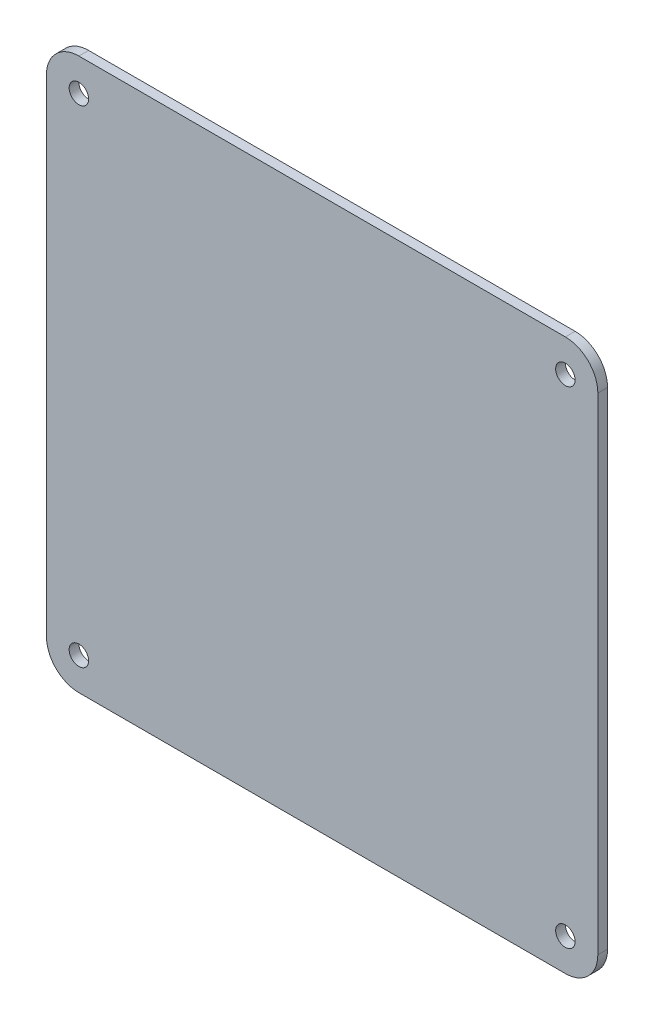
ISO-10303-21;
HEADER;
FILE_DESCRIPTION(('STEP AP214'),'2;1');
FILE_NAME('part.step','',(''),(''),'','','');
FILE_SCHEMA(('AUTOMOTIVE_DESIGN { 1 0 10303 214 1 1 1 1 }'));
ENDSEC;
DATA;
#1=APPLICATION_CONTEXT('core data for automotive mechanical design processes');
#2=APPLICATION_PROTOCOL_DEFINITION('international standard','automotive_design',2000,#1);
#3=PRODUCT_CONTEXT('',#1,'mechanical');
#4=PRODUCT('Part','Part','',(#3));
#5=PRODUCT_RELATED_PRODUCT_CATEGORY('part','',(#4));
#6=PRODUCT_DEFINITION_FORMATION('','',#4);
#7=PRODUCT_DEFINITION_CONTEXT('part definition',#1,'design');
#8=PRODUCT_DEFINITION('design','',#6,#7);
#9=PRODUCT_DEFINITION_SHAPE('','',#8);
#10=(LENGTH_UNIT() NAMED_UNIT(*) SI_UNIT(.MILLI.,.METRE.));
#11=(NAMED_UNIT(*) PLANE_ANGLE_UNIT() SI_UNIT($,.RADIAN.));
#12=(NAMED_UNIT(*) SI_UNIT($,.STERADIAN.) SOLID_ANGLE_UNIT());
#13=UNCERTAINTY_MEASURE_WITH_UNIT(LENGTH_MEASURE(1.E-05),#10,'distance_accuracy_value','');
#14=(GEOMETRIC_REPRESENTATION_CONTEXT(3) GLOBAL_UNCERTAINTY_ASSIGNED_CONTEXT((#13)) GLOBAL_UNIT_ASSIGNED_CONTEXT((#10,
#11,#12)) REPRESENTATION_CONTEXT('',''));
#15=CARTESIAN_POINT('',(0.,0.,0.));
#16=DIRECTION('',(0.,0.,1.));
#17=DIRECTION('',(1.,0.,0.));
#18=AXIS2_PLACEMENT_3D('',#15,#16,#17);
#19=CARTESIAN_POINT('',(75.,-75.,3.));
#20=DIRECTION('',(0.,0.,1.));
#21=DIRECTION('',(1.,0.,0.));
#22=AXIS2_PLACEMENT_3D('',#19,#20,#21);
#23=PLANE('',#22);
#24=CARTESIAN_POINT('',(75.,-75.,3.));
#25=DIRECTION('',(0.,0.,1.));
#26=DIRECTION('',(1.,0.,0.));
#27=AXIS2_PLACEMENT_3D('',#24,#25,#26);
#28=CIRCLE('',#27,3.);
#29=CARTESIAN_POINT('',(78.,-75.,3.));
#30=VERTEX_POINT('',#29);
#31=EDGE_CURVE('E197',#30,#30,#28,.T.);
#32=ORIENTED_EDGE('',*,*,#31,.F.);
#33=EDGE_LOOP('',(#32));
#34=FACE_BOUND('',#33,.T.);
#35=CARTESIAN_POINT('',(-75.,75.,3.));
#36=DIRECTION('',(0.,0.,1.));
#37=DIRECTION('',(1.,0.,0.));
#38=AXIS2_PLACEMENT_3D('',#35,#36,#37);
#39=CIRCLE('',#38,3.00000000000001);
#40=CARTESIAN_POINT('',(-72.,75.,3.));
#41=VERTEX_POINT('',#40);
#42=EDGE_CURVE('E143',#41,#41,#39,.T.);
#43=ORIENTED_EDGE('',*,*,#42,.F.);
#44=EDGE_LOOP('',(#43));
#45=FACE_BOUND('',#44,.T.);
#46=CARTESIAN_POINT('',(75.,-75.,3.));
#47=DIRECTION('',(0.,0.,1.));
#48=DIRECTION('',(1.,0.,0.));
#49=AXIS2_PLACEMENT_3D('',#46,#47,#48);
#50=CIRCLE('',#49,9.99999999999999);
#51=CARTESIAN_POINT('',(75.,-85.,3.));
#52=VERTEX_POINT('',#51);
#53=CARTESIAN_POINT('',(85.,-74.9999999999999,3.));
#54=VERTEX_POINT('',#53);
#55=EDGE_CURVE('E154',#52,#54,#50,.T.);
#56=ORIENTED_EDGE('',*,*,#55,.T.);
#57=DIRECTION('',(0.,1.,0.));
#58=VECTOR('',#57,1.);
#59=CARTESIAN_POINT('',(85.,-74.9999999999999,3.));
#60=LINE('',#59,#58);
#61=CARTESIAN_POINT('',(85.,75.,3.));
#62=VERTEX_POINT('',#61);
#63=EDGE_CURVE('E102',#54,#62,#60,.T.);
#64=ORIENTED_EDGE('',*,*,#63,.T.);
#65=CARTESIAN_POINT('',(75.,75.,3.));
#66=DIRECTION('',(0.,0.,1.));
#67=DIRECTION('',(1.,0.,0.));
#68=AXIS2_PLACEMENT_3D('',#65,#66,#67);
#69=CIRCLE('',#68,9.99999999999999);
#70=CARTESIAN_POINT('',(75.,85.,3.));
#71=VERTEX_POINT('',#70);
#72=EDGE_CURVE('E169',#62,#71,#69,.T.);
#73=ORIENTED_EDGE('',*,*,#72,.T.);
#74=DIRECTION('',(-1.,0.,0.));
#75=VECTOR('',#74,1.);
#76=CARTESIAN_POINT('',(75.,85.,3.));
#77=LINE('',#76,#75);
#78=CARTESIAN_POINT('',(-74.9999999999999,85.,3.));
#79=VERTEX_POINT('',#78);
#80=EDGE_CURVE('E182',#71,#79,#77,.T.);
#81=ORIENTED_EDGE('',*,*,#80,.T.);
#82=CARTESIAN_POINT('',(-75.,75.,3.));
#83=DIRECTION('',(0.,0.,1.));
#84=DIRECTION('',(1.,0.,0.));
#85=AXIS2_PLACEMENT_3D('',#82,#83,#84);
#86=CIRCLE('',#85,9.99999999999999);
#87=CARTESIAN_POINT('',(-85.,74.9999999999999,3.));
#88=VERTEX_POINT('',#87);
#89=EDGE_CURVE('E121',#79,#88,#86,.T.);
#90=ORIENTED_EDGE('',*,*,#89,.T.);
#91=DIRECTION('',(0.,-1.,0.));
#92=VECTOR('',#91,1.);
#93=CARTESIAN_POINT('',(-85.,-74.9999999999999,3.));
#94=LINE('',#93,#92);
#95=CARTESIAN_POINT('',(-85.,-75.,3.));
#96=VERTEX_POINT('',#95);
#97=EDGE_CURVE('E115',#88,#96,#94,.T.);
#98=ORIENTED_EDGE('',*,*,#97,.T.);
#99=CARTESIAN_POINT('',(-75.,-75.,3.));
#100=DIRECTION('',(0.,0.,1.));
#101=DIRECTION('',(-1.,0.,0.));
#102=AXIS2_PLACEMENT_3D('',#99,#100,#101);
#103=CIRCLE('',#102,10.);
#104=CARTESIAN_POINT('',(-74.9999999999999,-85.,3.));
#105=VERTEX_POINT('',#104);
#106=EDGE_CURVE('E119',#96,#105,#103,.T.);
#107=ORIENTED_EDGE('',*,*,#106,.T.);
#108=DIRECTION('',(1.,0.,0.));
#109=VECTOR('',#108,1.);
#110=CARTESIAN_POINT('',(75.,-85.,3.));
#111=LINE('',#110,#109);
#112=EDGE_CURVE('E59',#105,#52,#111,.T.);
#113=ORIENTED_EDGE('',*,*,#112,.T.);
#114=EDGE_LOOP('',(#56,#64,#73,#81,#90,#98,#107,#113));
#115=FACE_BOUND('',#114,.T.);
#116=CARTESIAN_POINT('',(75.,75.,3.));
#117=DIRECTION('',(0.,0.,1.));
#118=DIRECTION('',(-1.,0.,0.));
#119=AXIS2_PLACEMENT_3D('',#116,#117,#118);
#120=CIRCLE('',#119,3.);
#121=CARTESIAN_POINT('',(72.,75.,3.));
#122=VERTEX_POINT('',#121);
#123=EDGE_CURVE('E191',#122,#122,#120,.T.);
#124=ORIENTED_EDGE('',*,*,#123,.F.);
#125=EDGE_LOOP('',(#124));
#126=FACE_BOUND('',#125,.T.);
#127=CARTESIAN_POINT('',(-75.,-75.,3.));
#128=DIRECTION('',(0.,0.,1.));
#129=DIRECTION('',(-1.,0.,0.));
#130=AXIS2_PLACEMENT_3D('',#127,#128,#129);
#131=CIRCLE('',#130,3.00000000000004);
#132=CARTESIAN_POINT('',(-78.,-75.,3.));
#133=VERTEX_POINT('',#132);
#134=EDGE_CURVE('E203',#133,#133,#131,.T.);
#135=ORIENTED_EDGE('',*,*,#134,.F.);
#136=EDGE_LOOP('',(#135));
#137=FACE_BOUND('',#136,.T.);
#138=ADVANCED_FACE('F42',(#34,#45,#115,#126,#137),#23,.T.);
#139=CARTESIAN_POINT('',(75.,-75.,0.));
#140=DIRECTION('',(0.,0.,1.));
#141=DIRECTION('',(1.,0.,0.));
#142=AXIS2_PLACEMENT_3D('',#139,#140,#141);
#143=PLANE('',#142);
#144=CARTESIAN_POINT('',(75.,-75.,0.));
#145=DIRECTION('',(0.,0.,1.));
#146=DIRECTION('',(1.,0.,0.));
#147=AXIS2_PLACEMENT_3D('',#144,#145,#146);
#148=CIRCLE('',#147,9.99999999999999);
#149=CARTESIAN_POINT('',(75.,-85.,0.));
#150=VERTEX_POINT('',#149);
#151=CARTESIAN_POINT('',(85.,-74.9999999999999,0.));
#152=VERTEX_POINT('',#151);
#153=EDGE_CURVE('E139',#150,#152,#148,.T.);
#154=ORIENTED_EDGE('',*,*,#153,.F.);
#155=DIRECTION('',(1.,0.,0.));
#156=VECTOR('',#155,1.);
#157=CARTESIAN_POINT('',(75.,-85.,0.));
#158=LINE('',#157,#156);
#159=CARTESIAN_POINT('',(-74.9999999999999,-85.,0.));
#160=VERTEX_POINT('',#159);
#161=EDGE_CURVE('E94',#160,#150,#158,.T.);
#162=ORIENTED_EDGE('',*,*,#161,.F.);
#163=CARTESIAN_POINT('',(-75.,-75.,0.));
#164=DIRECTION('',(0.,0.,1.));
#165=DIRECTION('',(-1.,0.,0.));
#166=AXIS2_PLACEMENT_3D('',#163,#164,#165);
#167=CIRCLE('',#166,10.);
#168=CARTESIAN_POINT('',(-85.,-75.,0.));
#169=VERTEX_POINT('',#168);
#170=EDGE_CURVE('E88',#169,#160,#167,.T.);
#171=ORIENTED_EDGE('',*,*,#170,.F.);
#172=DIRECTION('',(0.,-1.,0.));
#173=VECTOR('',#172,1.);
#174=CARTESIAN_POINT('',(-85.,-74.9999999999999,0.));
#175=LINE('',#174,#173);
#176=CARTESIAN_POINT('',(-85.,74.9999999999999,0.));
#177=VERTEX_POINT('',#176);
#178=EDGE_CURVE('E129',#177,#169,#175,.T.);
#179=ORIENTED_EDGE('',*,*,#178,.F.);
#180=CARTESIAN_POINT('',(-75.,75.,0.));
#181=DIRECTION('',(0.,0.,1.));
#182=DIRECTION('',(1.,0.,0.));
#183=AXIS2_PLACEMENT_3D('',#180,#181,#182);
#184=CIRCLE('',#183,9.99999999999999);
#185=CARTESIAN_POINT('',(-74.9999999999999,85.,0.));
#186=VERTEX_POINT('',#185);
#187=EDGE_CURVE('E149',#186,#177,#184,.T.);
#188=ORIENTED_EDGE('',*,*,#187,.F.);
#189=DIRECTION('',(-1.,0.,0.));
#190=VECTOR('',#189,1.);
#191=CARTESIAN_POINT('',(75.,85.,0.));
#192=LINE('',#191,#190);
#193=CARTESIAN_POINT('',(75.,85.,0.));
#194=VERTEX_POINT('',#193);
#195=EDGE_CURVE('E147',#194,#186,#192,.T.);
#196=ORIENTED_EDGE('',*,*,#195,.F.);
#197=CARTESIAN_POINT('',(75.,75.,0.));
#198=DIRECTION('',(0.,0.,1.));
#199=DIRECTION('',(1.,0.,0.));
#200=AXIS2_PLACEMENT_3D('',#197,#198,#199);
#201=CIRCLE('',#200,9.99999999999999);
#202=CARTESIAN_POINT('',(85.,75.,0.));
#203=VERTEX_POINT('',#202);
#204=EDGE_CURVE('E145',#203,#194,#201,.T.);
#205=ORIENTED_EDGE('',*,*,#204,.F.);
#206=DIRECTION('',(0.,1.,0.));
#207=VECTOR('',#206,1.);
#208=CARTESIAN_POINT('',(85.,-74.9999999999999,0.));
#209=LINE('',#208,#207);
#210=EDGE_CURVE('E142',#152,#203,#209,.T.);
#211=ORIENTED_EDGE('',*,*,#210,.F.);
#212=EDGE_LOOP('',(#154,#162,#171,#179,#188,#196,#205,#211));
#213=FACE_BOUND('',#212,.T.);
#214=CARTESIAN_POINT('',(-75.,75.,0.));
#215=DIRECTION('',(0.,0.,1.));
#216=DIRECTION('',(1.,0.,0.));
#217=AXIS2_PLACEMENT_3D('',#214,#215,#216);
#218=CIRCLE('',#217,3.00000000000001);
#219=CARTESIAN_POINT('',(-72.,75.,0.));
#220=VERTEX_POINT('',#219);
#221=EDGE_CURVE('E188',#220,#220,#218,.T.);
#222=ORIENTED_EDGE('',*,*,#221,.T.);
#223=EDGE_LOOP('',(#222));
#224=FACE_BOUND('',#223,.T.);
#225=CARTESIAN_POINT('',(75.,75.,0.));
#226=DIRECTION('',(0.,0.,1.));
#227=DIRECTION('',(-1.,0.,0.));
#228=AXIS2_PLACEMENT_3D('',#225,#226,#227);
#229=CIRCLE('',#228,3.);
#230=CARTESIAN_POINT('',(72.,75.,0.));
#231=VERTEX_POINT('',#230);
#232=EDGE_CURVE('E194',#231,#231,#229,.T.);
#233=ORIENTED_EDGE('',*,*,#232,.T.);
#234=EDGE_LOOP('',(#233));
#235=FACE_BOUND('',#234,.T.);
#236=CARTESIAN_POINT('',(75.,-75.,0.));
#237=DIRECTION('',(0.,0.,1.));
#238=DIRECTION('',(1.,0.,0.));
#239=AXIS2_PLACEMENT_3D('',#236,#237,#238);
#240=CIRCLE('',#239,3.);
#241=CARTESIAN_POINT('',(78.,-75.,0.));
#242=VERTEX_POINT('',#241);
#243=EDGE_CURVE('E200',#242,#242,#240,.T.);
#244=ORIENTED_EDGE('',*,*,#243,.T.);
#245=EDGE_LOOP('',(#244));
#246=FACE_BOUND('',#245,.T.);
#247=CARTESIAN_POINT('',(-75.,-75.,0.));
#248=DIRECTION('',(0.,0.,1.));
#249=DIRECTION('',(-1.,0.,0.));
#250=AXIS2_PLACEMENT_3D('',#247,#248,#249);
#251=CIRCLE('',#250,3.00000000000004);
#252=CARTESIAN_POINT('',(-78.,-75.,0.));
#253=VERTEX_POINT('',#252);
#254=EDGE_CURVE('E206',#253,#253,#251,.T.);
#255=ORIENTED_EDGE('',*,*,#254,.T.);
#256=EDGE_LOOP('',(#255));
#257=FACE_BOUND('',#256,.T.);
#258=ADVANCED_FACE('F173',(#213,#224,#235,#246,#257),#143,.F.);
#259=CARTESIAN_POINT('',(75.,-75.,3.));
#260=DIRECTION('',(0.,0.,-1.));
#261=DIRECTION('',(-1.,0.,0.));
#262=AXIS2_PLACEMENT_3D('',#259,#260,#261);
#263=CYLINDRICAL_SURFACE('',#262,9.99999999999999);
#264=ORIENTED_EDGE('',*,*,#153,.T.);
#265=DIRECTION('',(0.,0.,-1.));
#266=VECTOR('',#265,1.);
#267=CARTESIAN_POINT('',(85.,-74.9999999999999,3.));
#268=LINE('',#267,#266);
#269=EDGE_CURVE('E11',#54,#152,#268,.T.);
#270=ORIENTED_EDGE('',*,*,#269,.F.);
#271=ORIENTED_EDGE('',*,*,#55,.F.);
#272=DIRECTION('',(0.,0.,-1.));
#273=VECTOR('',#272,1.);
#274=CARTESIAN_POINT('',(75.,-85.,3.));
#275=LINE('',#274,#273);
#276=EDGE_CURVE('E135',#52,#150,#275,.T.);
#277=ORIENTED_EDGE('',*,*,#276,.T.);
#278=EDGE_LOOP('',(#264,#270,#271,#277));
#279=FACE_BOUND('',#278,.T.);
#280=ADVANCED_FACE('F44',(#279),#263,.T.);
#281=CARTESIAN_POINT('',(85.,-74.9999999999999,3.));
#282=DIRECTION('',(-1.,0.,0.));
#283=DIRECTION('',(0.,0.,1.));
#284=AXIS2_PLACEMENT_3D('',#281,#282,#283);
#285=PLANE('',#284);
#286=ORIENTED_EDGE('',*,*,#210,.T.);
#287=DIRECTION('',(0.,0.,-1.));
#288=VECTOR('',#287,1.);
#289=CARTESIAN_POINT('',(85.,75.,3.));
#290=LINE('',#289,#288);
#291=EDGE_CURVE('E51',#62,#203,#290,.T.);
#292=ORIENTED_EDGE('',*,*,#291,.F.);
#293=ORIENTED_EDGE('',*,*,#63,.F.);
#294=ORIENTED_EDGE('',*,*,#269,.T.);
#295=EDGE_LOOP('',(#286,#292,#293,#294));
#296=FACE_BOUND('',#295,.T.);
#297=ADVANCED_FACE('F240',(#296),#285,.F.);
#298=CARTESIAN_POINT('',(75.,75.,3.));
#299=DIRECTION('',(0.,0.,-1.));
#300=DIRECTION('',(-1.,0.,0.));
#301=AXIS2_PLACEMENT_3D('',#298,#299,#300);
#302=CYLINDRICAL_SURFACE('',#301,9.99999999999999);
#303=ORIENTED_EDGE('',*,*,#204,.T.);
#304=DIRECTION('',(0.,0.,-1.));
#305=VECTOR('',#304,1.);
#306=CARTESIAN_POINT('',(75.,85.,3.));
#307=LINE('',#306,#305);
#308=EDGE_CURVE('E161',#71,#194,#307,.T.);
#309=ORIENTED_EDGE('',*,*,#308,.F.);
#310=ORIENTED_EDGE('',*,*,#72,.F.);
#311=ORIENTED_EDGE('',*,*,#291,.T.);
#312=EDGE_LOOP('',(#303,#309,#310,#311));
#313=FACE_BOUND('',#312,.T.);
#314=ADVANCED_FACE('F167',(#313),#302,.T.);
#315=CARTESIAN_POINT('',(75.,85.,3.));
#316=DIRECTION('',(0.,-1.,0.));
#317=DIRECTION('',(1.,0.,0.));
#318=AXIS2_PLACEMENT_3D('',#315,#316,#317);
#319=PLANE('',#318);
#320=ORIENTED_EDGE('',*,*,#195,.T.);
#321=DIRECTION('',(0.,0.,-1.));
#322=VECTOR('',#321,1.);
#323=CARTESIAN_POINT('',(-74.9999999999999,85.,3.));
#324=LINE('',#323,#322);
#325=EDGE_CURVE('E158',#79,#186,#324,.T.);
#326=ORIENTED_EDGE('',*,*,#325,.F.);
#327=ORIENTED_EDGE('',*,*,#80,.F.);
#328=ORIENTED_EDGE('',*,*,#308,.T.);
#329=EDGE_LOOP('',(#320,#326,#327,#328));
#330=FACE_BOUND('',#329,.T.);
#331=ADVANCED_FACE('F178',(#330),#319,.F.);
#332=CARTESIAN_POINT('',(-75.,75.,3.));
#333=DIRECTION('',(0.,0.,-1.));
#334=DIRECTION('',(-1.,0.,0.));
#335=AXIS2_PLACEMENT_3D('',#332,#333,#334);
#336=CYLINDRICAL_SURFACE('',#335,9.99999999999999);
#337=ORIENTED_EDGE('',*,*,#187,.T.);
#338=DIRECTION('',(0.,0.,-1.));
#339=VECTOR('',#338,1.);
#340=CARTESIAN_POINT('',(-85.,74.9999999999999,3.));
#341=LINE('',#340,#339);
#342=EDGE_CURVE('E130',#88,#177,#341,.T.);
#343=ORIENTED_EDGE('',*,*,#342,.F.);
#344=ORIENTED_EDGE('',*,*,#89,.F.);
#345=ORIENTED_EDGE('',*,*,#325,.T.);
#346=EDGE_LOOP('',(#337,#343,#344,#345));
#347=FACE_BOUND('',#346,.T.);
#348=ADVANCED_FACE('F181',(#347),#336,.T.);
#349=CARTESIAN_POINT('',(-85.,-74.9999999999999,3.));
#350=DIRECTION('',(1.,0.,0.));
#351=DIRECTION('',(0.,0.,-1.));
#352=AXIS2_PLACEMENT_3D('',#349,#350,#351);
#353=PLANE('',#352);
#354=ORIENTED_EDGE('',*,*,#178,.T.);
#355=DIRECTION('',(0.,0.,-1.));
#356=VECTOR('',#355,1.);
#357=CARTESIAN_POINT('',(-85.,-75.,3.));
#358=LINE('',#357,#356);
#359=EDGE_CURVE('E126',#96,#169,#358,.T.);
#360=ORIENTED_EDGE('',*,*,#359,.F.);
#361=ORIENTED_EDGE('',*,*,#97,.F.);
#362=ORIENTED_EDGE('',*,*,#342,.T.);
#363=EDGE_LOOP('',(#354,#360,#361,#362));
#364=FACE_BOUND('',#363,.T.);
#365=ADVANCED_FACE('F127',(#364),#353,.F.);
#366=CARTESIAN_POINT('',(-75.,-75.,3.));
#367=DIRECTION('',(0.,0.,-1.));
#368=DIRECTION('',(-1.,0.,0.));
#369=AXIS2_PLACEMENT_3D('',#366,#367,#368);
#370=CYLINDRICAL_SURFACE('',#369,10.);
#371=ORIENTED_EDGE('',*,*,#170,.T.);
#372=DIRECTION('',(0.,0.,-1.));
#373=VECTOR('',#372,1.);
#374=CARTESIAN_POINT('',(-74.9999999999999,-85.,3.));
#375=LINE('',#374,#373);
#376=EDGE_CURVE('E131',#105,#160,#375,.T.);
#377=ORIENTED_EDGE('',*,*,#376,.F.);
#378=ORIENTED_EDGE('',*,*,#106,.F.);
#379=ORIENTED_EDGE('',*,*,#359,.T.);
#380=EDGE_LOOP('',(#371,#377,#378,#379));
#381=FACE_BOUND('',#380,.T.);
#382=ADVANCED_FACE('F133',(#381),#370,.T.);
#383=CARTESIAN_POINT('',(75.,-85.,3.));
#384=DIRECTION('',(0.,1.,0.));
#385=DIRECTION('',(-1.,0.,0.));
#386=AXIS2_PLACEMENT_3D('',#383,#384,#385);
#387=PLANE('',#386);
#388=ORIENTED_EDGE('',*,*,#161,.T.);
#389=ORIENTED_EDGE('',*,*,#276,.F.);
#390=ORIENTED_EDGE('',*,*,#112,.F.);
#391=ORIENTED_EDGE('',*,*,#376,.T.);
#392=EDGE_LOOP('',(#388,#389,#390,#391));
#393=FACE_BOUND('',#392,.T.);
#394=ADVANCED_FACE('F228',(#393),#387,.F.);
#395=CARTESIAN_POINT('',(-75.,75.,3.));
#396=DIRECTION('',(0.,0.,-1.));
#397=DIRECTION('',(-1.,0.,0.));
#398=AXIS2_PLACEMENT_3D('',#395,#396,#397);
#399=CYLINDRICAL_SURFACE('',#398,3.00000000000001);
#400=ORIENTED_EDGE('',*,*,#42,.T.);
#401=EDGE_LOOP('',(#400));
#402=FACE_BOUND('',#401,.T.);
#403=ORIENTED_EDGE('',*,*,#221,.F.);
#404=EDGE_LOOP('',(#403));
#405=FACE_BOUND('',#404,.T.);
#406=ADVANCED_FACE('F225',(#402,#405),#399,.F.);
#407=CARTESIAN_POINT('',(75.,75.,3.));
#408=DIRECTION('',(0.,0.,-1.));
#409=DIRECTION('',(-1.,0.,0.));
#410=AXIS2_PLACEMENT_3D('',#407,#408,#409);
#411=CYLINDRICAL_SURFACE('',#410,3.);
#412=ORIENTED_EDGE('',*,*,#123,.T.);
#413=EDGE_LOOP('',(#412));
#414=FACE_BOUND('',#413,.T.);
#415=ORIENTED_EDGE('',*,*,#232,.F.);
#416=EDGE_LOOP('',(#415));
#417=FACE_BOUND('',#416,.T.);
#418=ADVANCED_FACE('F303',(#414,#417),#411,.F.);
#419=CARTESIAN_POINT('',(75.,-75.,3.));
#420=DIRECTION('',(0.,0.,-1.));
#421=DIRECTION('',(-1.,0.,0.));
#422=AXIS2_PLACEMENT_3D('',#419,#420,#421);
#423=CYLINDRICAL_SURFACE('',#422,3.);
#424=ORIENTED_EDGE('',*,*,#31,.T.);
#425=EDGE_LOOP('',(#424));
#426=FACE_BOUND('',#425,.T.);
#427=ORIENTED_EDGE('',*,*,#243,.F.);
#428=EDGE_LOOP('',(#427));
#429=FACE_BOUND('',#428,.T.);
#430=ADVANCED_FACE('F311',(#426,#429),#423,.F.);
#431=CARTESIAN_POINT('',(-75.,-75.,3.));
#432=DIRECTION('',(0.,0.,-1.));
#433=DIRECTION('',(-1.,0.,0.));
#434=AXIS2_PLACEMENT_3D('',#431,#432,#433);
#435=CYLINDRICAL_SURFACE('',#434,3.00000000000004);
#436=ORIENTED_EDGE('',*,*,#134,.T.);
#437=EDGE_LOOP('',(#436));
#438=FACE_BOUND('',#437,.T.);
#439=ORIENTED_EDGE('',*,*,#254,.F.);
#440=EDGE_LOOP('',(#439));
#441=FACE_BOUND('',#440,.T.);
#442=ADVANCED_FACE('F212',(#438,#441),#435,.F.);
#443=CLOSED_SHELL('',(#138,#258,#280,#297,#314,#331,#348,#365,#382,#394,#406,#418,#430,#442));
#444=MANIFOLD_SOLID_BREP('B2',#443);
#445=ADVANCED_BREP_SHAPE_REPRESENTATION('',(#18,#444),#14);
#446=SHAPE_DEFINITION_REPRESENTATION(#9,#445);
ENDSEC;
END-ISO-10303-21;
